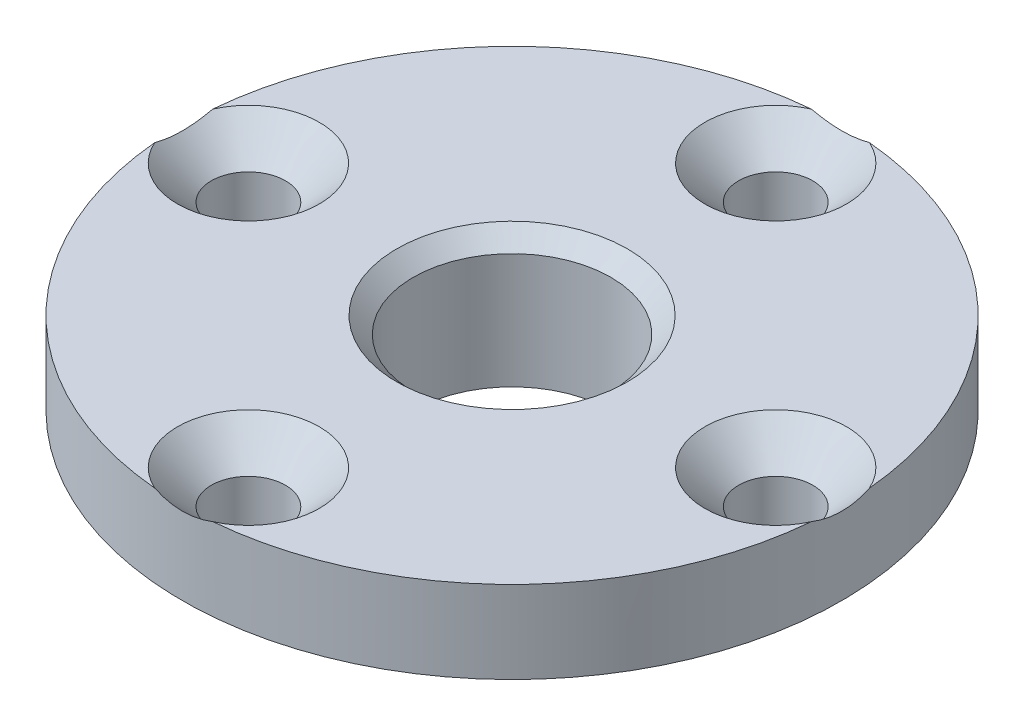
ISO-10303-21;
HEADER;
FILE_DESCRIPTION(('STEP AP214'),'2;1');
FILE_NAME('part.step','',(''),(''),'','','');
FILE_SCHEMA(('AUTOMOTIVE_DESIGN { 1 0 10303 214 1 1 1 1 }'));
ENDSEC;
DATA;
#1=APPLICATION_CONTEXT('core data for automotive mechanical design processes');
#2=APPLICATION_PROTOCOL_DEFINITION('international standard','automotive_design',2000,#1);
#3=PRODUCT_CONTEXT('',#1,'mechanical');
#4=PRODUCT('Part','Part','',(#3));
#5=PRODUCT_RELATED_PRODUCT_CATEGORY('part','',(#4));
#6=PRODUCT_DEFINITION_FORMATION('','',#4);
#7=PRODUCT_DEFINITION_CONTEXT('part definition',#1,'design');
#8=PRODUCT_DEFINITION('design','',#6,#7);
#9=PRODUCT_DEFINITION_SHAPE('','',#8);
#10=(LENGTH_UNIT() NAMED_UNIT(*) SI_UNIT(.MILLI.,.METRE.));
#11=(NAMED_UNIT(*) PLANE_ANGLE_UNIT() SI_UNIT($,.RADIAN.));
#12=(NAMED_UNIT(*) SI_UNIT($,.STERADIAN.) SOLID_ANGLE_UNIT());
#13=UNCERTAINTY_MEASURE_WITH_UNIT(LENGTH_MEASURE(1.E-05),#10,'distance_accuracy_value','');
#14=(GEOMETRIC_REPRESENTATION_CONTEXT(3) GLOBAL_UNCERTAINTY_ASSIGNED_CONTEXT((#13)) GLOBAL_UNIT_ASSIGNED_CONTEXT((#10,
#11,#12)) REPRESENTATION_CONTEXT('',''));
#15=CARTESIAN_POINT('',(0.,0.,0.));
#16=DIRECTION('',(0.,0.,1.));
#17=DIRECTION('',(1.,0.,0.));
#18=AXIS2_PLACEMENT_3D('',#15,#16,#17);
#19=CARTESIAN_POINT('',(0.,8.00000000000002,20.));
#20=DIRECTION('',(0.,-1.00000000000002,0.));
#21=DIRECTION('',(0.,0.,-1.00000000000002));
#22=AXIS2_PLACEMENT_3D('',#19,#20,#21);
#23=PLANE('',#22);
#24=CARTESIAN_POINT('',(0.,8.00000000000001,0.));
#25=DIRECTION('',(0.,-1.00000000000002,0.));
#26=DIRECTION('',(0.,0.,-1.00000000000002));
#27=AXIS2_PLACEMENT_3D('',#24,#25,#26);
#28=CIRCLE('',#27,7.);
#29=CARTESIAN_POINT('',(1.28841382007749E-13,8.,-7.00000000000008));
#30=VERTEX_POINT('',#29);
#31=EDGE_CURVE('E34',#30,#30,#28,.T.);
#32=ORIENTED_EDGE('',*,*,#31,.T.);
#33=EDGE_LOOP('',(#32));
#34=FACE_BOUND('',#33,.T.);
#35=CARTESIAN_POINT('',(-16.0000000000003,8.00000000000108,3.88578058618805E-13));
#36=DIRECTION('',(0.,1.00000000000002,0.));
#37=DIRECTION('',(0.,0.,1.00000000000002));
#38=AXIS2_PLACEMENT_3D('',#35,#36,#37);
#39=CIRCLE('',#38,4.3);
#40=CARTESIAN_POINT('',(-19.9221875,8.00000000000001,1.76251105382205));
#41=VERTEX_POINT('',#40);
#42=CARTESIAN_POINT('',(-19.9221875,8.00000000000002,-1.76251105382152));
#43=VERTEX_POINT('',#42);
#44=EDGE_CURVE('E40',#41,#43,#39,.T.);
#45=ORIENTED_EDGE('',*,*,#44,.F.);
#46=CARTESIAN_POINT('',(0.,8.00000000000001,0.));
#47=DIRECTION('',(0.,-1.00000000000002,0.));
#48=DIRECTION('',(0.,0.,-1.00000000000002));
#49=AXIS2_PLACEMENT_3D('',#46,#47,#48);
#50=CIRCLE('',#49,20.);
#51=CARTESIAN_POINT('',(-1.76251105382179,8.00000000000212,19.9221875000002));
#52=VERTEX_POINT('',#51);
#53=EDGE_CURVE('E76',#52,#41,#50,.T.);
#54=ORIENTED_EDGE('',*,*,#53,.F.);
#55=CARTESIAN_POINT('',(0.,8.00000000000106,16.));
#56=DIRECTION('',(0.,1.00000000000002,0.));
#57=DIRECTION('',(0.,0.,1.00000000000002));
#58=AXIS2_PLACEMENT_3D('',#55,#56,#57);
#59=CIRCLE('',#58,4.3);
#60=CARTESIAN_POINT('',(1.76251105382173,8.00000000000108,19.9221875));
#61=VERTEX_POINT('',#60);
#62=EDGE_CURVE('E207',#61,#52,#59,.T.);
#63=ORIENTED_EDGE('',*,*,#62,.F.);
#64=CARTESIAN_POINT('',(19.9221875,8.00000000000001,1.76251105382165));
#65=VERTEX_POINT('',#64);
#66=EDGE_CURVE('E87',#65,#61,#50,.T.);
#67=ORIENTED_EDGE('',*,*,#66,.F.);
#68=CARTESIAN_POINT('',(16.,8.00000000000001,0.));
#69=DIRECTION('',(0.,1.00000000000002,0.));
#70=DIRECTION('',(0.,0.,1.00000000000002));
#71=AXIS2_PLACEMENT_3D('',#68,#69,#70);
#72=CIRCLE('',#71,4.3);
#73=CARTESIAN_POINT('',(19.9221875,8.00000000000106,-1.76251105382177));
#74=VERTEX_POINT('',#73);
#75=EDGE_CURVE('E211',#74,#65,#72,.T.);
#76=ORIENTED_EDGE('',*,*,#75,.F.);
#77=CARTESIAN_POINT('',(1.76251105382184,7.99999999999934,-19.9221875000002));
#78=VERTEX_POINT('',#77);
#79=EDGE_CURVE('E91',#78,#74,#50,.T.);
#80=ORIENTED_EDGE('',*,*,#79,.F.);
#81=CARTESIAN_POINT('',(0.,8.00000000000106,-16.));
#82=DIRECTION('',(0.,1.00000000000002,0.));
#83=DIRECTION('',(0.,0.,1.00000000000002));
#84=AXIS2_PLACEMENT_3D('',#81,#82,#83);
#85=CIRCLE('',#84,4.3);
#86=CARTESIAN_POINT('',(-1.76251105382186,7.99999999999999,-19.9221875));
#87=VERTEX_POINT('',#86);
#88=EDGE_CURVE('E47',#87,#78,#85,.T.);
#89=ORIENTED_EDGE('',*,*,#88,.F.);
#90=EDGE_CURVE('E77',#43,#87,#50,.T.);
#91=ORIENTED_EDGE('',*,*,#90,.F.);
#92=EDGE_LOOP('',(#45,#54,#63,#67,#76,#80,#89,#91));
#93=FACE_BOUND('',#92,.T.);
#94=ADVANCED_FACE('F26',(#34,#93),#23,.F.);
#95=CARTESIAN_POINT('',(0.,-6.71847009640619,0.));
#96=DIRECTION('',(0.,-1.00000000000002,0.));
#97=DIRECTION('',(0.,0.,-1.00000000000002));
#98=AXIS2_PLACEMENT_3D('',#95,#96,#97);
#99=CYLINDRICAL_SURFACE('',#98,13.4);
#100=CARTESIAN_POINT('',(0.,0.500000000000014,0.));
#101=DIRECTION('',(0.,1.00000000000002,0.));
#102=DIRECTION('',(0.,0.,1.00000000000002));
#103=AXIS2_PLACEMENT_3D('',#100,#101,#102);
#104=CIRCLE('',#103,13.4);
#105=CARTESIAN_POINT('',(-2.99771318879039E-13,0.500000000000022,13.4000000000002));
#106=VERTEX_POINT('',#105);
#107=EDGE_CURVE('E137',#106,#106,#104,.T.);
#108=ORIENTED_EDGE('',*,*,#107,.T.);
#109=EDGE_LOOP('',(#108));
#110=FACE_BOUND('',#109,.T.);
#111=CARTESIAN_POINT('',(0.,3.,0.));
#112=DIRECTION('',(0.,-1.00000000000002,0.));
#113=DIRECTION('',(0.,0.,-1.00000000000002));
#114=AXIS2_PLACEMENT_3D('',#111,#112,#113);
#115=CIRCLE('',#114,13.4);
#116=CARTESIAN_POINT('',(2.99771318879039E-13,2.99999999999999,-13.4000000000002));
#117=VERTEX_POINT('',#116);
#118=EDGE_CURVE('E89',#117,#117,#115,.T.);
#119=ORIENTED_EDGE('',*,*,#118,.T.);
#120=EDGE_LOOP('',(#119));
#121=FACE_BOUND('',#120,.T.);
#122=ADVANCED_FACE('F28',(#110,#121),#99,.T.);
#123=CARTESIAN_POINT('',(0.,3.00000000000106,13.4));
#124=DIRECTION('',(0.,1.00000000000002,0.));
#125=DIRECTION('',(0.,0.,1.00000000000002));
#126=AXIS2_PLACEMENT_3D('',#123,#124,#125);
#127=PLANE('',#126);
#128=CARTESIAN_POINT('',(-16.,3.00000000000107,1.52655665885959E-13));
#129=DIRECTION('',(0.,1.00000000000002,0.));
#130=DIRECTION('',(0.,0.,1.00000000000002));
#131=AXIS2_PLACEMENT_3D('',#128,#129,#130);
#132=CIRCLE('',#131,2.25);
#133=CARTESIAN_POINT('',(-16.0000000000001,3.00000000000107,2.25000000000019));
#134=VERTEX_POINT('',#133);
#135=EDGE_CURVE('E78',#134,#134,#132,.T.);
#136=ORIENTED_EDGE('',*,*,#135,.T.);
#137=EDGE_LOOP('',(#136));
#138=FACE_BOUND('',#137,.T.);
#139=CARTESIAN_POINT('',(-1.38777878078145E-13,3.,-16.));
#140=DIRECTION('',(0.,1.00000000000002,0.));
#141=DIRECTION('',(0.,0.,1.00000000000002));
#142=AXIS2_PLACEMENT_3D('',#139,#140,#141);
#143=CIRCLE('',#142,2.25);
#144=CARTESIAN_POINT('',(-1.89112614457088E-13,3.,-13.75));
#145=VERTEX_POINT('',#144);
#146=EDGE_CURVE('E218',#145,#145,#143,.T.);
#147=ORIENTED_EDGE('',*,*,#146,.T.);
#148=EDGE_LOOP('',(#147));
#149=FACE_BOUND('',#148,.T.);
#150=CARTESIAN_POINT('',(16.,2.99999999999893,-1.11022302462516E-13));
#151=DIRECTION('',(0.,1.00000000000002,0.));
#152=DIRECTION('',(0.,0.,1.00000000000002));
#153=AXIS2_PLACEMENT_3D('',#150,#151,#152);
#154=CIRCLE('',#153,2.25);
#155=CARTESIAN_POINT('',(16.,2.99999999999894,2.24999999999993));
#156=VERTEX_POINT('',#155);
#157=EDGE_CURVE('E208',#156,#156,#154,.T.);
#158=ORIENTED_EDGE('',*,*,#157,.T.);
#159=EDGE_LOOP('',(#158));
#160=FACE_BOUND('',#159,.T.);
#161=CARTESIAN_POINT('',(-1.2490009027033E-13,3.,16.0000000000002));
#162=DIRECTION('',(0.,1.00000000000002,0.));
#163=DIRECTION('',(0.,0.,1.00000000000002));
#164=AXIS2_PLACEMENT_3D('',#161,#162,#163);
#165=CIRCLE('',#164,2.25);
#166=CARTESIAN_POINT('',(-1.75234826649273E-13,3.,18.2500000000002));
#167=VERTEX_POINT('',#166);
#168=EDGE_CURVE('E99',#167,#167,#165,.T.);
#169=ORIENTED_EDGE('',*,*,#168,.T.);
#170=EDGE_LOOP('',(#169));
#171=FACE_BOUND('',#170,.T.);
#172=ORIENTED_EDGE('',*,*,#118,.F.);
#173=EDGE_LOOP('',(#172));
#174=FACE_BOUND('',#173,.T.);
#175=CARTESIAN_POINT('',(0.,3.,0.));
#176=DIRECTION('',(0.,-1.00000000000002,0.));
#177=DIRECTION('',(0.,0.,-1.00000000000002));
#178=AXIS2_PLACEMENT_3D('',#175,#176,#177);
#179=CIRCLE('',#178,20.);
#180=CARTESIAN_POINT('',(4.47419878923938E-13,2.99999999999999,-20.0000000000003));
#181=VERTEX_POINT('',#180);
#182=EDGE_CURVE('E85',#181,#181,#179,.T.);
#183=ORIENTED_EDGE('',*,*,#182,.T.);
#184=EDGE_LOOP('',(#183));
#185=FACE_BOUND('',#184,.T.);
#186=ADVANCED_FACE('F132',(#138,#149,#160,#171,#174,#185),#127,.F.);
#187=CARTESIAN_POINT('',(0.,-6.71847009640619,0.));
#188=DIRECTION('',(0.,-1.00000000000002,0.));
#189=DIRECTION('',(0.,0.,-1.00000000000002));
#190=AXIS2_PLACEMENT_3D('',#187,#188,#189);
#191=CYLINDRICAL_SURFACE('',#190,20.);
#192=ORIENTED_EDGE('',*,*,#182,.F.);
#193=EDGE_LOOP('',(#192));
#194=FACE_BOUND('',#193,.T.);
#195=ORIENTED_EDGE('',*,*,#53,.T.);
#196=CARTESIAN_POINT('',(-19.2771116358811,9.95559171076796,5.32850513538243));
#197=CARTESIAN_POINT('',(-19.3139659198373,9.86134279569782,5.19516214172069));
#198=CARTESIAN_POINT('',(-19.349615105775,9.7680189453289,5.06081877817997));
#199=CARTESIAN_POINT('',(-19.4184606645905,9.58368179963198,4.78988176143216));
#200=CARTESIAN_POINT('',(-19.4516563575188,9.49266914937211,4.65328749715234));
#201=CARTESIAN_POINT('',(-19.5157990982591,9.31271780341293,4.3765196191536));
#202=CARTESIAN_POINT('',(-19.5467250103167,9.22380282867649,4.23632562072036));
#203=CARTESIAN_POINT('',(-19.6059441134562,9.04952122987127,3.95321041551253));
#204=CARTESIAN_POINT('',(-19.6342375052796,8.96415433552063,3.81028941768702));
#205=CARTESIAN_POINT('',(-19.6893541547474,8.79394145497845,3.51468060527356));
#206=CARTESIAN_POINT('',(-19.7160478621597,8.70930429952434,3.36184767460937));
#207=CARTESIAN_POINT('',(-19.7663165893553,8.54608382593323,3.05242526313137));
#208=CARTESIAN_POINT('',(-19.789891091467,8.46750151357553,2.89583516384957));
#209=CARTESIAN_POINT('',(-19.8336562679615,8.31828396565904,2.57906163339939));
#210=CARTESIAN_POINT('',(-19.8538578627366,8.24762333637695,2.41889178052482));
#211=CARTESIAN_POINT('',(-19.8907210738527,8.11602257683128,2.09424960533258));
#212=CARTESIAN_POINT('',(-19.9073844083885,8.05507773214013,1.92977941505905));
#213=CARTESIAN_POINT('',(-19.9357761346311,7.94944090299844,1.60896570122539));
#214=CARTESIAN_POINT('',(-19.9477810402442,7.90387240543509,1.45293866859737));
#215=CARTESIAN_POINT('',(-19.9682527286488,7.8252235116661,1.13747600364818));
#216=CARTESIAN_POINT('',(-19.9767193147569,7.79214380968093,0.978040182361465));
#217=CARTESIAN_POINT('',(-19.9897756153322,7.74077229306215,0.658812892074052));
#218=CARTESIAN_POINT('',(-19.9944160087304,7.72228731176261,0.499055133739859));
#219=CARTESIAN_POINT('',(-19.9998460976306,7.70063143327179,0.178439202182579));
#220=CARTESIAN_POINT('',(-20.0006365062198,7.69745770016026,0.0175812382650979));
#221=CARTESIAN_POINT('',(-19.9985055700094,7.70597355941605,-0.280560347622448));
#222=CARTESIAN_POINT('',(-19.9961009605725,7.71559411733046,-0.417912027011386));
#223=CARTESIAN_POINT('',(-19.9885160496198,7.74570300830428,-0.69132309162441));
#224=CARTESIAN_POINT('',(-19.9833358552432,7.76619092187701,-0.827382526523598));
#225=CARTESIAN_POINT('',(-19.9702888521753,7.81720804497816,-1.09820136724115));
#226=CARTESIAN_POINT('',(-19.9624079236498,7.84778999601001,-1.23295003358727));
#227=CARTESIAN_POINT('',(-19.9441237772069,7.91773276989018,-1.49994725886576));
#228=CARTESIAN_POINT('',(-19.9337203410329,7.95709435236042,-1.63219560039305));
#229=CARTESIAN_POINT('',(-19.8977637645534,8.09086375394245,-2.03848760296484));
#230=CARTESIAN_POINT('',(-19.868159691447,8.19809063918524,-2.30799321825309));
#231=CARTESIAN_POINT('',(-19.8168737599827,8.37585374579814,-2.70356215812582));
#232=CARTESIAN_POINT('',(-19.7986128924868,8.4379901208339,-2.83408015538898));
#233=CARTESIAN_POINT('',(-19.759903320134,8.56695456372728,-3.09245298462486));
#234=CARTESIAN_POINT('',(-19.7394548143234,8.63378220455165,-3.22030805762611));
#235=CARTESIAN_POINT('',(-19.6748125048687,8.84052256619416,-3.60115462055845));
#236=CARTESIAN_POINT('',(-19.6274503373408,8.98623948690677,-3.85045128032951));
#237=CARTESIAN_POINT('',(-19.5248846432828,9.28806790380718,-4.34068207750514));
#238=CARTESIAN_POINT('',(-19.4696860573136,9.44417281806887,-4.58162136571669));
#239=CARTESIAN_POINT('',(-19.3846033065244,9.67475787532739,-4.92431538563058));
#240=CARTESIAN_POINT('',(-19.3577442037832,9.74627190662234,-5.02884514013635));
#241=CARTESIAN_POINT('',(-19.3025681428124,9.89055814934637,-5.23664312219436));
#242=CARTESIAN_POINT('',(-19.2742511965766,9.96333035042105,-5.33991136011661));
#243=CARTESIAN_POINT('',(-19.1876035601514,10.1821222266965,-5.64629358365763));
#244=CARTESIAN_POINT('',(-19.1271575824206,10.3297547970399,-5.8476649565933));
#245=CARTESIAN_POINT('',(-19.0639433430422,10.4789241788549,-6.04698802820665));
#246=B_SPLINE_CURVE_WITH_KNOTS('',3,(#196,#197,#198,#199,#200,#201,#202,#203,#204,#205,#206,
#207,#208,#209,#210,#211,#212,#213,#214,#215,#216,#217,#218,#219,#220,#221,#222,#223,#224,#225,
#226,#227,#228,#229,#230,#231,#232,#233,#234,#235,#236,#237,#238,#239,#240,#241,#242,#243,#244,
#245),.UNSPECIFIED.,.F.,.F.,(4,2,2,2,2,2,2,2,2,2,2,2,2,2,2,2,2,2,2,2,2,2,2,2,4),(0.,
0.502194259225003,1.00452717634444,1.51106265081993,2.01755946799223,2.54760982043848,
3.07774803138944,3.60613506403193,4.13426491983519,4.62275803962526,5.11127830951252,
5.59321906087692,6.07507054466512,6.48772448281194,6.90036249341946,7.31519160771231,
7.73005662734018,8.60263880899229,9.03969224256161,9.47670594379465,10.3539769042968,
11.2306972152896,11.6190870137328,12.0074736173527,12.7780354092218),.UNSPECIFIED.);
#247=EDGE_CURVE('E65',#41,#43,#246,.T.);
#248=ORIENTED_EDGE('',*,*,#247,.T.);
#249=ORIENTED_EDGE('',*,*,#90,.T.);
#250=CARTESIAN_POINT('',(-6.04698802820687,10.4789241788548,-19.0639433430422));
#251=CARTESIAN_POINT('',(-5.90531858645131,10.3728841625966,-19.1088761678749));
#252=CARTESIAN_POINT('',(-5.76260499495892,10.2676321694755,-19.1524100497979));
#253=CARTESIAN_POINT('',(-5.47486293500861,10.0591103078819,-19.2366419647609));
#254=CARTESIAN_POINT('',(-5.32983397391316,9.95584087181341,-19.2773393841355));
#255=CARTESIAN_POINT('',(-5.03642512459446,9.75112902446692,-19.3560745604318));
#256=CARTESIAN_POINT('',(-4.88803043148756,9.64970114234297,-19.3940950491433));
#257=CARTESIAN_POINT('',(-4.58847957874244,9.44990646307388,-19.4671421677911));
#258=CARTESIAN_POINT('',(-4.43732362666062,9.35153943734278,-19.5021690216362));
#259=CARTESIAN_POINT('',(-4.1319436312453,9.15862877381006,-19.5691460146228));
#260=CARTESIAN_POINT('',(-3.97772002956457,9.06408459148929,-19.6010965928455));
#261=CARTESIAN_POINT('',(-3.66577896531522,8.879780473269,-19.6618238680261));
#262=CARTESIAN_POINT('',(-3.50806099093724,8.79002124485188,-19.6906000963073));
#263=CARTESIAN_POINT('',(-3.18911883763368,8.61681775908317,-19.7447619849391));
#264=CARTESIAN_POINT('',(-3.02790414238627,8.53335864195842,-19.7701557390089));
#265=CARTESIAN_POINT('',(-2.70120246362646,8.37422754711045,-19.8174349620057));
#266=CARTESIAN_POINT('',(-2.53571738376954,8.29855217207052,-19.8393219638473));
#267=CARTESIAN_POINT('',(-2.31839911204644,8.20699003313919,-19.8652337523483));
#268=CARTESIAN_POINT('',(-2.26866751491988,8.18655542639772,-19.8709756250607));
#269=CARTESIAN_POINT('',(-2.16879201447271,8.14661900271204,-19.8821242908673));
#270=CARTESIAN_POINT('',(-2.11864810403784,8.12711720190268,-19.8875310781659));
#271=CARTESIAN_POINT('',(-1.96740541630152,8.07004028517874,-19.9032561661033));
#272=CARTESIAN_POINT('',(-1.86568017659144,8.0339719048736,-19.9130571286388));
#273=CARTESIAN_POINT('',(-1.60987313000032,7.94973876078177,-19.9356958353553));
#274=CARTESIAN_POINT('',(-1.45476037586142,7.90440455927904,-19.9476407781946));
#275=CARTESIAN_POINT('',(-1.14122249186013,7.82608105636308,-19.9680312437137));
#276=CARTESIAN_POINT('',(-0.982798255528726,7.79308846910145,-19.9764776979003));
#277=CARTESIAN_POINT('',(-0.663647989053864,7.74137816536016,-19.9896231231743));
#278=CARTESIAN_POINT('',(-0.502925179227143,7.72264215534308,-19.9943268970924));
#279=CARTESIAN_POINT('',(-0.180374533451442,7.70067050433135,-19.9998364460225));
#280=CARTESIAN_POINT('',(-0.0185470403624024,7.69743025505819,-20.0006433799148));
#281=CARTESIAN_POINT('',(0.28090974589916,7.70598341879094,-19.9985030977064));
#282=CARTESIAN_POINT('',(0.418609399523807,7.7156430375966,-19.9960887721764));
#283=CARTESIAN_POINT('',(0.692726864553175,7.7458856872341,-19.9884698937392));
#284=CARTESIAN_POINT('',(0.829144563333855,7.7664696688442,-19.983265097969));
#285=CARTESIAN_POINT('',(1.09995046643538,7.8175916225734,-19.9701902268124));
#286=CARTESIAN_POINT('',(1.23433853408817,7.84813026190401,-19.9623199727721));
#287=CARTESIAN_POINT('',(1.50064621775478,7.91793952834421,-19.9440687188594));
#288=CARTESIAN_POINT('',(1.63256574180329,7.95721048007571,-19.9336876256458));
#289=CARTESIAN_POINT('',(1.80093019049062,8.01265094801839,-19.9187874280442));
#290=CARTESIAN_POINT('',(1.838627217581,8.02541382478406,-19.9153427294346));
#291=CARTESIAN_POINT('',(2.03259655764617,8.09281762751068,-19.8970656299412));
#292=CARTESIAN_POINT('',(2.18706058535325,8.15232268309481,-19.880652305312));
#293=CARTESIAN_POINT('',(2.49216075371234,8.2796443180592,-19.8447160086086));
#294=CARTESIAN_POINT('',(2.64279529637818,8.34746430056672,-19.8251917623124));
#295=CARTESIAN_POINT('',(2.94093039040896,8.48996653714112,-19.7831660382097));
#296=CARTESIAN_POINT('',(3.08841963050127,8.56466964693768,-19.7606554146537));
#297=CARTESIAN_POINT('',(3.38006605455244,8.7193979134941,-19.7128634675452));
#298=CARTESIAN_POINT('',(3.52422383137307,8.79942211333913,-19.6875826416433));
#299=CARTESIAN_POINT('',(3.8111808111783,8.96468224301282,-19.6340633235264));
#300=CARTESIAN_POINT('',(3.95394618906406,9.04996689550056,-19.6057946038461));
#301=CARTESIAN_POINT('',(4.23675950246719,9.22407721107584,-19.5466298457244));
#302=CARTESIAN_POINT('',(4.37680715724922,9.31290323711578,-19.515733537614));
#303=CARTESIAN_POINT('',(4.65340827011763,9.49274918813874,-19.4516272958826));
#304=CARTESIAN_POINT('',(4.78997996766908,9.58374788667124,-19.418436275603));
#305=CARTESIAN_POINT('',(5.06086906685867,9.76805388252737,-19.3496017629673));
#306=CARTESIAN_POINT('',(5.19518713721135,9.86136047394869,-19.3139590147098));
#307=CARTESIAN_POINT('',(5.32850513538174,9.95559171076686,-19.2771116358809));
#308=B_SPLINE_CURVE_WITH_KNOTS('',3,(#250,#251,#252,#253,#254,#255,#256,#257,#258,#259,#260,
#261,#262,#263,#264,#265,#266,#267,#268,#269,#270,#271,#272,#273,#274,#275,#276,#277,#278,#279,
#280,#281,#282,#283,#284,#285,#286,#287,#288,#289,#290,#291,#292,#293,#294,#295,#296,#297,#298,
#299,#300,#301,#302,#303,#304,#305,#306,#307),.UNSPECIFIED.,.F.,.F.,(4,2,2,2,2,2,2,2,2,2,2,2,2,
2,2,2,2,2,2,2,2,2,2,2,2,2,2,2,4),(0.,0.547727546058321,1.09557322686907,1.64667901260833,
2.19774354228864,2.74872930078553,3.2997963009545,3.84952004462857,4.399002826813,
4.56121067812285,4.72342133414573,5.0484469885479,5.53409318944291,6.01960999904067,
6.50450275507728,6.98925130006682,7.40295301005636,7.81669073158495,8.23045618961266,
8.64423703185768,8.76407935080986,9.26270224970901,9.7615299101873,10.261922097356,
10.7622245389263,11.2681875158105,11.7742024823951,12.2764545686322,12.7785548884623),.UNSPECIFIED.);
#309=EDGE_CURVE('E71',#87,#78,#308,.T.);
#310=ORIENTED_EDGE('',*,*,#309,.T.);
#311=ORIENTED_EDGE('',*,*,#79,.T.);
#312=CARTESIAN_POINT('',(19.0639433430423,10.4789241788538,-6.04698802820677));
#313=CARTESIAN_POINT('',(19.1088761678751,10.3728841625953,-5.90531858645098));
#314=CARTESIAN_POINT('',(19.152410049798,10.2676321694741,-5.76260499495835));
#315=CARTESIAN_POINT('',(19.2366419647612,10.0591103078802,-5.47486293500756));
#316=CARTESIAN_POINT('',(19.2773393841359,9.95584087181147,-5.32983397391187));
#317=CARTESIAN_POINT('',(19.3560745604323,9.75112902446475,-5.03642512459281));
#318=CARTESIAN_POINT('',(19.3940950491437,9.64970114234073,-4.88803043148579));
#319=CARTESIAN_POINT('',(19.4671421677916,9.44990646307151,-4.58847957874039));
#320=CARTESIAN_POINT('',(19.5021690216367,9.35153943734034,-4.43732362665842));
#321=CARTESIAN_POINT('',(19.5691460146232,9.15862877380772,-4.1319436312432));
#322=CARTESIAN_POINT('',(19.6010965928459,9.06408459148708,-3.9777200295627));
#323=CARTESIAN_POINT('',(19.6618238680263,8.87978047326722,-3.66577896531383));
#324=CARTESIAN_POINT('',(19.6906000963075,8.79002124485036,-3.50806099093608));
#325=CARTESIAN_POINT('',(19.7447619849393,8.61681775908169,-3.18911883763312));
#326=CARTESIAN_POINT('',(19.7701557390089,8.5333586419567,-3.02790414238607));
#327=CARTESIAN_POINT('',(19.8174349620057,8.37422754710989,-2.70120246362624));
#328=CARTESIAN_POINT('',(19.8393219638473,8.29855217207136,-2.53571738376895));
#329=CARTESIAN_POINT('',(19.8652337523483,8.20699003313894,-2.31839911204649));
#330=CARTESIAN_POINT('',(19.8709756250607,8.18655542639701,-2.26866751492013));
#331=CARTESIAN_POINT('',(19.8821242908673,8.14661900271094,-2.16879201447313));
#332=CARTESIAN_POINT('',(19.8875310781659,8.12711720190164,-2.11864810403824));
#333=CARTESIAN_POINT('',(19.9032561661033,8.07004028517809,-1.96740541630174));
#334=CARTESIAN_POINT('',(19.9130571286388,8.0339719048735,-1.86568017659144));
#335=CARTESIAN_POINT('',(19.9356958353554,7.94973876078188,-1.60987313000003));
#336=CARTESIAN_POINT('',(19.9476407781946,7.90440455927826,-1.45476037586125));
#337=CARTESIAN_POINT('',(19.9680312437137,7.82608105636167,-1.14122249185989));
#338=CARTESIAN_POINT('',(19.9764776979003,7.79308846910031,-0.982798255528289));
#339=CARTESIAN_POINT('',(19.9896231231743,7.74137816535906,-0.663647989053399));
#340=CARTESIAN_POINT('',(19.9943268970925,7.72264215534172,-0.502925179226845));
#341=CARTESIAN_POINT('',(19.9998364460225,7.70067050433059,-0.180374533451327));
#342=CARTESIAN_POINT('',(20.0006433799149,7.6974302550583,-0.0185470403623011));
#343=CARTESIAN_POINT('',(19.9985030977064,7.70598341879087,0.280909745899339));
#344=CARTESIAN_POINT('',(19.9960887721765,7.71564303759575,0.418609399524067));
#345=CARTESIAN_POINT('',(19.9884698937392,7.74588568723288,0.692726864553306));
#346=CARTESIAN_POINT('',(19.983265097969,7.7664696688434,0.829144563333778));
#347=CARTESIAN_POINT('',(19.9701902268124,7.81759162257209,1.09995046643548));
#348=CARTESIAN_POINT('',(19.962319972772,7.8481302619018,1.23433853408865));
#349=CARTESIAN_POINT('',(19.9440687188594,7.91793952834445,1.50064621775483));
#350=CARTESIAN_POINT('',(19.933687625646,7.95721048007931,1.63256574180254));
#351=CARTESIAN_POINT('',(19.9187874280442,8.01265094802,1.80093019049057));
#352=CARTESIAN_POINT('',(19.9153427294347,8.02541382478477,1.83862721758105));
#353=CARTESIAN_POINT('',(19.8970656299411,8.0928176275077,2.03259655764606));
#354=CARTESIAN_POINT('',(19.8806523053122,8.15232268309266,2.18706058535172));
#355=CARTESIAN_POINT('',(19.8447160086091,8.27964431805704,2.49216075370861));
#356=CARTESIAN_POINT('',(19.825191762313,8.34746430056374,2.64279529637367));
#357=CARTESIAN_POINT('',(19.7831660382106,8.48996653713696,2.94093039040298));
#358=CARTESIAN_POINT('',(19.7606554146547,8.56466964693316,3.0884196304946));
#359=CARTESIAN_POINT('',(19.7128634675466,8.7193979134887,3.38006605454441));
#360=CARTESIAN_POINT('',(19.6875826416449,8.79942211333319,3.52422383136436));
#361=CARTESIAN_POINT('',(19.6340633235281,8.96468224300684,3.81118081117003));
#362=CARTESIAN_POINT('',(19.6057946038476,9.04996689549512,3.95394618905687));
#363=CARTESIAN_POINT('',(19.5466298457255,9.22407721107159,4.23675950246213));
#364=CARTESIAN_POINT('',(19.515733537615,9.31290323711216,4.3768071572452));
#365=CARTESIAN_POINT('',(19.4516272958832,9.4927491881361,4.6534082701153));
#366=CARTESIAN_POINT('',(19.4184362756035,9.58374788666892,4.78997996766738));
#367=CARTESIAN_POINT('',(19.3496017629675,9.76805388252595,5.06086906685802));
#368=CARTESIAN_POINT('',(19.3139590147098,9.86136047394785,5.19518713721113));
#369=CARTESIAN_POINT('',(19.2771116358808,9.95559171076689,5.32850513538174));
#370=B_SPLINE_CURVE_WITH_KNOTS('',3,(#312,#313,#314,#315,#316,#317,#318,#319,#320,#321,#322,
#323,#324,#325,#326,#327,#328,#329,#330,#331,#332,#333,#334,#335,#336,#337,#338,#339,#340,#341,
#342,#343,#344,#345,#346,#347,#348,#349,#350,#351,#352,#353,#354,#355,#356,#357,#358,#359,#360,
#361,#362,#363,#364,#365,#366,#367,#368,#369),.UNSPECIFIED.,.F.,.F.,(4,2,2,2,2,2,2,2,2,2,2,2,2,
2,2,2,2,2,2,2,2,2,2,2,2,2,2,2,4),(0.,0.547727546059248,1.09557322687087,1.64667901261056,
2.19774354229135,2.74872930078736,3.29979630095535,3.84952004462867,4.39900282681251,
4.56121067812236,4.7234213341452,5.0484469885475,5.53409318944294,6.01960999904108,
6.50450275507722,6.98925130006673,7.40295301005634,7.81669073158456,8.23045618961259,
8.64423703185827,8.76407935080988,9.26270224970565,9.76152991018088,10.2619220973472,
10.7622245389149,11.2681875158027,11.7742024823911,12.2764545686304,12.7785548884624),.UNSPECIFIED.);
#371=EDGE_CURVE('E173',#74,#65,#370,.T.);
#372=ORIENTED_EDGE('',*,*,#371,.T.);
#373=ORIENTED_EDGE('',*,*,#66,.T.);
#374=CARTESIAN_POINT('',(5.32850513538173,9.95559171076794,19.2771116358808));
#375=CARTESIAN_POINT('',(5.19516214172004,9.86134279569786,19.3139659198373));
#376=CARTESIAN_POINT('',(5.06081877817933,9.76801894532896,19.3496151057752));
#377=CARTESIAN_POINT('',(4.78988176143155,9.58368179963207,19.4184606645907));
#378=CARTESIAN_POINT('',(4.65328749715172,9.4926691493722,19.451656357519));
#379=CARTESIAN_POINT('',(4.37651961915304,9.31271780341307,19.5157990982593));
#380=CARTESIAN_POINT('',(4.23632562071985,9.22380282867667,19.5467250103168));
#381=CARTESIAN_POINT('',(3.95321041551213,9.04952122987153,19.6059441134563));
#382=CARTESIAN_POINT('',(3.81028941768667,8.96415433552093,19.6342375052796));
#383=CARTESIAN_POINT('',(3.5146806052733,8.79394145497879,19.6893541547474));
#384=CARTESIAN_POINT('',(3.36184767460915,8.70930429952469,19.7160478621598));
#385=CARTESIAN_POINT('',(3.0524252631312,8.54608382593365,19.7663165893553));
#386=CARTESIAN_POINT('',(2.89583516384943,8.467501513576,19.789891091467));
#387=CARTESIAN_POINT('',(2.57906163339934,8.31828396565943,19.8336562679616));
#388=CARTESIAN_POINT('',(2.41889178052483,8.2476233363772,19.8538578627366));
#389=CARTESIAN_POINT('',(2.09424960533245,8.11602257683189,19.8907210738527));
#390=CARTESIAN_POINT('',(1.92977941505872,8.05507773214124,19.9073844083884));
#391=CARTESIAN_POINT('',(1.60896570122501,7.94944090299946,19.935776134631));
#392=CARTESIAN_POINT('',(1.45293866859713,7.90387240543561,19.9477810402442));
#393=CARTESIAN_POINT('',(1.13747600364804,7.82522351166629,19.9682527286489));
#394=CARTESIAN_POINT('',(0.978040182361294,7.79214380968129,19.9767193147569));
#395=CARTESIAN_POINT('',(0.658812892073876,7.74077229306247,19.9897756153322));
#396=CARTESIAN_POINT('',(0.499055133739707,7.72228731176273,19.9944160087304));
#397=CARTESIAN_POINT('',(0.178439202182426,7.7006314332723,19.9998460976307));
#398=CARTESIAN_POINT('',(0.0175812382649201,7.69745770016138,20.0006365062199));
#399=CARTESIAN_POINT('',(-0.28056034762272,7.70597355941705,19.9985055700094));
#400=CARTESIAN_POINT('',(-0.417912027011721,7.71559411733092,19.9961009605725));
#401=CARTESIAN_POINT('',(-0.691323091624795,7.74570300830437,19.9885160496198));
#402=CARTESIAN_POINT('',(-0.82738252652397,7.76619092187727,19.9833358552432));
#403=CARTESIAN_POINT('',(-1.09820136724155,7.81720804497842,19.9702888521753));
#404=CARTESIAN_POINT('',(-1.23295003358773,7.84778999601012,19.9624079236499));
#405=CARTESIAN_POINT('',(-1.49994725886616,7.91773276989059,19.9441237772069));
#406=CARTESIAN_POINT('',(-1.63219560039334,7.95709435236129,19.9337203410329));
#407=CARTESIAN_POINT('',(-2.03848760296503,8.09086375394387,19.8977637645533));
#408=CARTESIAN_POINT('',(-2.30799321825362,8.19809063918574,19.868159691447));
#409=CARTESIAN_POINT('',(-2.70356215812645,8.37585374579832,19.8168737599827));
#410=CARTESIAN_POINT('',(-2.83408015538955,8.43799012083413,19.7986128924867));
#411=CARTESIAN_POINT('',(-3.09245298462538,8.56695456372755,19.7599033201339));
#412=CARTESIAN_POINT('',(-3.22030805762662,8.63378220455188,19.7394548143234));
#413=CARTESIAN_POINT('',(-3.60115462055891,8.84052256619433,19.6748125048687));
#414=CARTESIAN_POINT('',(-3.8504512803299,8.98623948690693,19.6274503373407));
#415=CARTESIAN_POINT('',(-4.34068207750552,9.28806790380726,19.5248846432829));
#416=CARTESIAN_POINT('',(-4.58162136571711,9.44417281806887,19.4696860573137));
#417=CARTESIAN_POINT('',(-4.92431538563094,9.67475787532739,19.3846033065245));
#418=CARTESIAN_POINT('',(-5.02884514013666,9.74627190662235,19.3577442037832));
#419=CARTESIAN_POINT('',(-5.23664312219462,9.89055814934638,19.3025681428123));
#420=CARTESIAN_POINT('',(-5.33991136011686,9.96333035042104,19.2742511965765));
#421=CARTESIAN_POINT('',(-5.64629358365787,10.1821222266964,19.1876035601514));
#422=CARTESIAN_POINT('',(-5.84766495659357,10.3297547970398,19.1271575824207));
#423=CARTESIAN_POINT('',(-6.04698802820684,10.4789241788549,19.0639433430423));
#424=B_SPLINE_CURVE_WITH_KNOTS('',3,(#374,#375,#376,#377,#378,#379,#380,#381,#382,#383,#384,
#385,#386,#387,#388,#389,#390,#391,#392,#393,#394,#395,#396,#397,#398,#399,#400,#401,#402,#403,
#404,#405,#406,#407,#408,#409,#410,#411,#412,#413,#414,#415,#416,#417,#418,#419,#420,#421,#422,
#423),.UNSPECIFIED.,.F.,.F.,(4,2,2,2,2,2,2,2,2,2,2,2,2,2,2,2,2,2,2,2,2,2,2,2,4),(0.,
0.502194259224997,1.0045271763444,1.51106265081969,2.01755946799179,2.54760982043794,
3.07774803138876,3.60613506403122,4.13426491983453,4.62275803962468,5.11127830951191,
5.59321906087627,6.07507054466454,6.48772448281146,6.900362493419,7.31519160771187,
7.73005662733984,8.60263880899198,9.03969224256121,9.4767059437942,10.3539769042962,
11.2306972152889,11.6190870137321,12.007473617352,12.778035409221),.UNSPECIFIED.);
#425=EDGE_CURVE('E84',#61,#52,#424,.T.);
#426=ORIENTED_EDGE('',*,*,#425,.T.);
#427=EDGE_LOOP('',(#195,#248,#249,#310,#311,#372,#373,#426));
#428=FACE_BOUND('',#427,.T.);
#429=ADVANCED_FACE('F82',(#194,#428),#191,.T.);
#430=CARTESIAN_POINT('',(0.,-6.71847009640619,0.));
#431=DIRECTION('',(0.,-1.00000000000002,0.));
#432=DIRECTION('',(0.,0.,-1.00000000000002));
#433=AXIS2_PLACEMENT_3D('',#430,#431,#432);
#434=CYLINDRICAL_SURFACE('',#433,6.);
#435=CARTESIAN_POINT('',(0.,6.99999999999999,0.));
#436=DIRECTION('',(0.,-1.00000000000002,0.));
#437=DIRECTION('',(0.,0.,-1.00000000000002));
#438=AXIS2_PLACEMENT_3D('',#435,#436,#437);
#439=CIRCLE('',#438,6.);
#440=CARTESIAN_POINT('',(1.20348175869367E-13,6.99999999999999,-6.00000000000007));
#441=VERTEX_POINT('',#440);
#442=EDGE_CURVE('E11',#441,#441,#439,.F.);
#443=ORIENTED_EDGE('',*,*,#442,.T.);
#444=EDGE_LOOP('',(#443));
#445=FACE_BOUND('',#444,.T.);
#446=CARTESIAN_POINT('',(0.,0.,0.));
#447=DIRECTION('',(0.,-1.00000000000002,0.));
#448=DIRECTION('',(0.,0.,-1.00000000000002));
#449=AXIS2_PLACEMENT_3D('',#446,#447,#448);
#450=CIRCLE('',#449,6.);
#451=CARTESIAN_POINT('',(1.34225963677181E-13,0.,-6.0000000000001));
#452=VERTEX_POINT('',#451);
#453=EDGE_CURVE('E93',#452,#452,#450,.T.);
#454=ORIENTED_EDGE('',*,*,#453,.T.);
#455=EDGE_LOOP('',(#454));
#456=FACE_BOUND('',#455,.T.);
#457=ADVANCED_FACE('F121',(#445,#456),#434,.F.);
#458=CARTESIAN_POINT('',(0.,0.,5.99999999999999));
#459=DIRECTION('',(0.,1.00000000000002,0.));
#460=DIRECTION('',(0.,0.,1.00000000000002));
#461=AXIS2_PLACEMENT_3D('',#458,#459,#460);
#462=PLANE('',#461);
#463=CARTESIAN_POINT('',(0.,0.,0.));
#464=DIRECTION('',(0.,1.00000000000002,0.));
#465=DIRECTION('',(0.,0.,1.00000000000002));
#466=AXIS2_PLACEMENT_3D('',#463,#464,#465);
#467=CIRCLE('',#466,13.1113248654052);
#468=CARTESIAN_POINT('',(-2.933133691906E-13,0.,13.1113248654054));
#469=VERTEX_POINT('',#468);
#470=EDGE_CURVE('E70',#469,#469,#467,.F.);
#471=ORIENTED_EDGE('',*,*,#470,.T.);
#472=EDGE_LOOP('',(#471));
#473=FACE_BOUND('',#472,.T.);
#474=ORIENTED_EDGE('',*,*,#453,.F.);
#475=EDGE_LOOP('',(#474));
#476=FACE_BOUND('',#475,.T.);
#477=ADVANCED_FACE('F116',(#473,#476),#462,.F.);
#478=CARTESIAN_POINT('',(0.,8.00000000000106,16.));
#479=DIRECTION('',(0.,1.00000000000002,0.));
#480=DIRECTION('',(0.,0.,1.00000000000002));
#481=AXIS2_PLACEMENT_3D('',#478,#479,#480);
#482=CONICAL_SURFACE('',#481,4.3,0.785398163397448);
#483=CARTESIAN_POINT('',(0.,5.95000000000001,16.));
#484=DIRECTION('',(0.,1.00000000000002,0.));
#485=DIRECTION('',(0.,0.,1.00000000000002));
#486=AXIS2_PLACEMENT_3D('',#483,#484,#485);
#487=CIRCLE('',#486,2.25);
#488=CARTESIAN_POINT('',(0.,5.95000000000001,18.25));
#489=VERTEX_POINT('',#488);
#490=EDGE_CURVE('E206',#489,#489,#487,.T.);
#491=ORIENTED_EDGE('',*,*,#490,.F.);
#492=EDGE_LOOP('',(#491));
#493=FACE_BOUND('',#492,.T.);
#494=ORIENTED_EDGE('',*,*,#62,.T.);
#495=ORIENTED_EDGE('',*,*,#425,.F.);
#496=EDGE_LOOP('',(#494,#495));
#497=FACE_BOUND('',#496,.T.);
#498=ADVANCED_FACE('F110',(#493,#497),#482,.F.);
#499=CARTESIAN_POINT('',(0.,8.00000000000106,16.));
#500=DIRECTION('',(0.,1.00000000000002,0.));
#501=DIRECTION('',(0.,0.,1.00000000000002));
#502=AXIS2_PLACEMENT_3D('',#499,#500,#501);
#503=CYLINDRICAL_SURFACE('',#502,2.25);
#504=ORIENTED_EDGE('',*,*,#168,.F.);
#505=EDGE_LOOP('',(#504));
#506=FACE_BOUND('',#505,.T.);
#507=ORIENTED_EDGE('',*,*,#490,.T.);
#508=EDGE_LOOP('',(#507));
#509=FACE_BOUND('',#508,.T.);
#510=ADVANCED_FACE('F115',(#506,#509),#503,.F.);
#511=CARTESIAN_POINT('',(16.,8.00000000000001,0.));
#512=DIRECTION('',(0.,1.00000000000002,0.));
#513=DIRECTION('',(0.,0.,1.00000000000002));
#514=AXIS2_PLACEMENT_3D('',#511,#512,#513);
#515=CONICAL_SURFACE('',#514,4.3,0.785398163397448);
#516=CARTESIAN_POINT('',(16.,5.95,0.));
#517=DIRECTION('',(0.,1.00000000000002,0.));
#518=DIRECTION('',(0.,0.,1.00000000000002));
#519=AXIS2_PLACEMENT_3D('',#516,#517,#518);
#520=CIRCLE('',#519,2.25);
#521=CARTESIAN_POINT('',(16.,5.95,2.25000000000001));
#522=VERTEX_POINT('',#521);
#523=EDGE_CURVE('E215',#522,#522,#520,.T.);
#524=ORIENTED_EDGE('',*,*,#523,.F.);
#525=EDGE_LOOP('',(#524));
#526=FACE_BOUND('',#525,.T.);
#527=ORIENTED_EDGE('',*,*,#75,.T.);
#528=ORIENTED_EDGE('',*,*,#371,.F.);
#529=EDGE_LOOP('',(#527,#528));
#530=FACE_BOUND('',#529,.T.);
#531=ADVANCED_FACE('F169',(#526,#530),#515,.F.);
#532=CARTESIAN_POINT('',(16.,8.00000000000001,0.));
#533=DIRECTION('',(0.,1.00000000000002,0.));
#534=DIRECTION('',(0.,0.,1.00000000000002));
#535=AXIS2_PLACEMENT_3D('',#532,#533,#534);
#536=CYLINDRICAL_SURFACE('',#535,2.25);
#537=ORIENTED_EDGE('',*,*,#157,.F.);
#538=EDGE_LOOP('',(#537));
#539=FACE_BOUND('',#538,.T.);
#540=ORIENTED_EDGE('',*,*,#523,.T.);
#541=EDGE_LOOP('',(#540));
#542=FACE_BOUND('',#541,.T.);
#543=ADVANCED_FACE('F166',(#539,#542),#536,.F.);
#544=CARTESIAN_POINT('',(0.,8.00000000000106,-16.));
#545=DIRECTION('',(0.,1.00000000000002,0.));
#546=DIRECTION('',(0.,0.,1.00000000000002));
#547=AXIS2_PLACEMENT_3D('',#544,#545,#546);
#548=CONICAL_SURFACE('',#547,4.3,0.785398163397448);
#549=CARTESIAN_POINT('',(-1.11022302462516E-13,5.95,-16.));
#550=DIRECTION('',(0.,1.00000000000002,0.));
#551=DIRECTION('',(0.,0.,1.00000000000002));
#552=AXIS2_PLACEMENT_3D('',#549,#550,#551);
#553=CIRCLE('',#552,2.25);
#554=CARTESIAN_POINT('',(-1.61357038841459E-13,5.95,-13.75));
#555=VERTEX_POINT('',#554);
#556=EDGE_CURVE('E222',#555,#555,#553,.T.);
#557=ORIENTED_EDGE('',*,*,#556,.F.);
#558=EDGE_LOOP('',(#557));
#559=FACE_BOUND('',#558,.T.);
#560=ORIENTED_EDGE('',*,*,#88,.T.);
#561=ORIENTED_EDGE('',*,*,#309,.F.);
#562=EDGE_LOOP('',(#560,#561));
#563=FACE_BOUND('',#562,.T.);
#564=ADVANCED_FACE('F161',(#559,#563),#548,.F.);
#565=CARTESIAN_POINT('',(0.,8.00000000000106,-16.));
#566=DIRECTION('',(0.,1.00000000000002,0.));
#567=DIRECTION('',(0.,0.,1.00000000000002));
#568=AXIS2_PLACEMENT_3D('',#565,#566,#567);
#569=CYLINDRICAL_SURFACE('',#568,2.25);
#570=ORIENTED_EDGE('',*,*,#146,.F.);
#571=EDGE_LOOP('',(#570));
#572=FACE_BOUND('',#571,.T.);
#573=ORIENTED_EDGE('',*,*,#556,.T.);
#574=EDGE_LOOP('',(#573));
#575=FACE_BOUND('',#574,.T.);
#576=ADVANCED_FACE('F157',(#572,#575),#569,.F.);
#577=CARTESIAN_POINT('',(-16.0000000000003,8.00000000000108,3.88578058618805E-13));
#578=DIRECTION('',(0.,1.00000000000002,0.));
#579=DIRECTION('',(0.,0.,1.00000000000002));
#580=AXIS2_PLACEMENT_3D('',#577,#578,#579);
#581=CONICAL_SURFACE('',#580,4.3,0.785398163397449);
#582=CARTESIAN_POINT('',(-16.0000000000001,5.95000000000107,1.66533453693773E-13));
#583=DIRECTION('',(0.,1.00000000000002,0.));
#584=DIRECTION('',(0.,0.,1.00000000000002));
#585=AXIS2_PLACEMENT_3D('',#582,#583,#584);
#586=CIRCLE('',#585,2.25);
#587=CARTESIAN_POINT('',(-16.0000000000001,5.95000000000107,2.2500000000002));
#588=VERTEX_POINT('',#587);
#589=EDGE_CURVE('E79',#588,#588,#586,.T.);
#590=ORIENTED_EDGE('',*,*,#589,.F.);
#591=EDGE_LOOP('',(#590));
#592=FACE_BOUND('',#591,.T.);
#593=ORIENTED_EDGE('',*,*,#44,.T.);
#594=ORIENTED_EDGE('',*,*,#247,.F.);
#595=EDGE_LOOP('',(#593,#594));
#596=FACE_BOUND('',#595,.T.);
#597=ADVANCED_FACE('F66',(#592,#596),#581,.F.);
#598=CARTESIAN_POINT('',(-16.0000000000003,8.00000000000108,3.88578058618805E-13));
#599=DIRECTION('',(0.,1.00000000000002,0.));
#600=DIRECTION('',(0.,0.,1.00000000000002));
#601=AXIS2_PLACEMENT_3D('',#598,#599,#600);
#602=CYLINDRICAL_SURFACE('',#601,2.25);
#603=ORIENTED_EDGE('',*,*,#135,.F.);
#604=EDGE_LOOP('',(#603));
#605=FACE_BOUND('',#604,.T.);
#606=ORIENTED_EDGE('',*,*,#589,.T.);
#607=EDGE_LOOP('',(#606));
#608=FACE_BOUND('',#607,.T.);
#609=ADVANCED_FACE('F156',(#605,#608),#602,.F.);
#610=CARTESIAN_POINT('',(0.,0.,0.));
#611=DIRECTION('',(0.,1.00000000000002,0.));
#612=DIRECTION('',(0.,0.,1.00000000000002));
#613=AXIS2_PLACEMENT_3D('',#610,#611,#612);
#614=CONICAL_SURFACE('',#613,13.1113248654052,0.523598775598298);
#615=ORIENTED_EDGE('',*,*,#107,.F.);
#616=EDGE_LOOP('',(#615));
#617=FACE_BOUND('',#616,.T.);
#618=ORIENTED_EDGE('',*,*,#470,.F.);
#619=EDGE_LOOP('',(#618));
#620=FACE_BOUND('',#619,.T.);
#621=ADVANCED_FACE('F231',(#617,#620),#614,.T.);
#622=CARTESIAN_POINT('',(0.,8.00000000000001,0.));
#623=DIRECTION('',(0.,1.00000000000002,0.));
#624=DIRECTION('',(0.,0.,1.00000000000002));
#625=AXIS2_PLACEMENT_3D('',#622,#623,#624);
#626=CONICAL_SURFACE('',#625,7.,0.785398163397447);
#627=ORIENTED_EDGE('',*,*,#442,.F.);
#628=EDGE_LOOP('',(#627));
#629=FACE_BOUND('',#628,.T.);
#630=ORIENTED_EDGE('',*,*,#31,.F.);
#631=EDGE_LOOP('',(#630));
#632=FACE_BOUND('',#631,.T.);
#633=ADVANCED_FACE('F236',(#629,#632),#626,.F.);
#634=CLOSED_SHELL('',(#94,#122,#186,#429,#457,#477,#498,#510,#531,#543,#564,#576,#597,#609,#621,#633));
#635=MANIFOLD_SOLID_BREP('B2',#634);
#636=ADVANCED_BREP_SHAPE_REPRESENTATION('',(#18,#635),#14);
#637=SHAPE_DEFINITION_REPRESENTATION(#9,#636);
ENDSEC;
END-ISO-10303-21;
